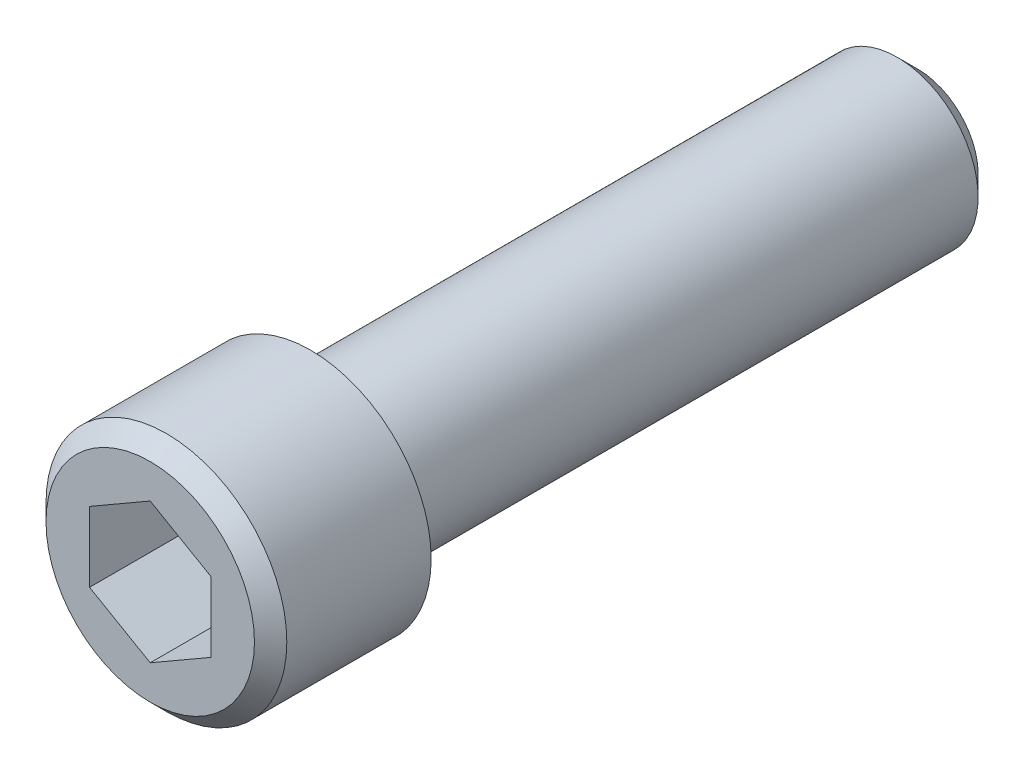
ISO-10303-21;
HEADER;
FILE_DESCRIPTION(('STEP AP214'),'2;1');
FILE_NAME('part.step','',(''),(''),'','','');
FILE_SCHEMA(('AUTOMOTIVE_DESIGN { 1 0 10303 214 1 1 1 1 }'));
ENDSEC;
DATA;
#1=APPLICATION_CONTEXT('core data for automotive mechanical design processes');
#2=APPLICATION_PROTOCOL_DEFINITION('international standard','automotive_design',2000,#1);
#3=PRODUCT_CONTEXT('',#1,'mechanical');
#4=PRODUCT('Part','Part','',(#3));
#5=PRODUCT_RELATED_PRODUCT_CATEGORY('part','',(#4));
#6=PRODUCT_DEFINITION_FORMATION('','',#4);
#7=PRODUCT_DEFINITION_CONTEXT('part definition',#1,'design');
#8=PRODUCT_DEFINITION('design','',#6,#7);
#9=PRODUCT_DEFINITION_SHAPE('','',#8);
#10=(LENGTH_UNIT() NAMED_UNIT(*) SI_UNIT(.MILLI.,.METRE.));
#11=(NAMED_UNIT(*) PLANE_ANGLE_UNIT() SI_UNIT($,.RADIAN.));
#12=(NAMED_UNIT(*) SI_UNIT($,.STERADIAN.) SOLID_ANGLE_UNIT());
#13=UNCERTAINTY_MEASURE_WITH_UNIT(LENGTH_MEASURE(1.E-05),#10,'distance_accuracy_value','');
#14=(GEOMETRIC_REPRESENTATION_CONTEXT(3) GLOBAL_UNCERTAINTY_ASSIGNED_CONTEXT((#13)) GLOBAL_UNIT_ASSIGNED_CONTEXT((#10,
#11,#12)) REPRESENTATION_CONTEXT('',''));
#15=CARTESIAN_POINT('',(0.,0.,0.));
#16=DIRECTION('',(0.,0.,1.));
#17=DIRECTION('',(1.,0.,0.));
#18=AXIS2_PLACEMENT_3D('',#15,#16,#17);
#19=CARTESIAN_POINT('',(3.,-5.19615242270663,3.4375));
#20=DIRECTION('',(0.,0.,1.));
#21=DIRECTION('',(1.,0.,0.));
#22=AXIS2_PLACEMENT_3D('',#19,#20,#21);
#23=PLANE('',#22);
#24=CARTESIAN_POINT('',(0.,0.,3.4375));
#25=DIRECTION('',(0.,0.,1.));
#26=DIRECTION('',(1.,0.,0.));
#27=AXIS2_PLACEMENT_3D('',#24,#25,#26);
#28=CIRCLE('',#27,3.);
#29=CARTESIAN_POINT('',(3.,0.,3.4375));
#30=VERTEX_POINT('',#29);
#31=CARTESIAN_POINT('',(1.5,2.59807621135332,3.4375));
#32=VERTEX_POINT('',#31);
#33=EDGE_CURVE('E25',#30,#32,#28,.T.);
#34=ORIENTED_EDGE('',*,*,#33,.F.);
#35=DIRECTION('',(0.,1.,0.));
#36=VECTOR('',#35,1.);
#37=CARTESIAN_POINT('',(3.,-1.73205080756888,3.4375));
#38=LINE('',#37,#36);
#39=CARTESIAN_POINT('',(3.,1.73205080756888,3.4375));
#40=VERTEX_POINT('',#39);
#41=EDGE_CURVE('E116',#30,#40,#38,.T.);
#42=ORIENTED_EDGE('',*,*,#41,.T.);
#43=DIRECTION('',(-0.866025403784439,0.5,0.));
#44=VECTOR('',#43,1.);
#45=CARTESIAN_POINT('',(3.,1.73205080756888,3.4375));
#46=LINE('',#45,#44);
#47=EDGE_CURVE('E112',#40,#32,#46,.T.);
#48=ORIENTED_EDGE('',*,*,#47,.T.);
#49=EDGE_LOOP('',(#34,#42,#48));
#50=FACE_BOUND('',#49,.T.);
#51=ADVANCED_FACE('F14',(#50),#23,.T.);
#52=CARTESIAN_POINT('',(-1.5,2.59807621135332,3.4375));
#53=VERTEX_POINT('',#52);
#54=EDGE_CURVE('E9',#32,#53,#28,.T.);
#55=ORIENTED_EDGE('',*,*,#54,.F.);
#56=CARTESIAN_POINT('',(0.,3.46410161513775,3.4375));
#57=VERTEX_POINT('',#56);
#58=EDGE_CURVE('E104',#32,#57,#46,.T.);
#59=ORIENTED_EDGE('',*,*,#58,.T.);
#60=DIRECTION('',(-0.866025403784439,-0.5,0.));
#61=VECTOR('',#60,1.);
#62=CARTESIAN_POINT('',(0.,3.46410161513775,3.4375));
#63=LINE('',#62,#61);
#64=EDGE_CURVE('E107',#57,#53,#63,.T.);
#65=ORIENTED_EDGE('',*,*,#64,.T.);
#66=EDGE_LOOP('',(#55,#59,#65));
#67=FACE_BOUND('',#66,.T.);
#68=ADVANCED_FACE('F103',(#67),#23,.T.);
#69=CARTESIAN_POINT('',(-3.,0.,3.4375));
#70=VERTEX_POINT('',#69);
#71=EDGE_CURVE('E23',#53,#70,#28,.T.);
#72=ORIENTED_EDGE('',*,*,#71,.F.);
#73=CARTESIAN_POINT('',(-3.,1.73205080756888,3.4375));
#74=VERTEX_POINT('',#73);
#75=EDGE_CURVE('E118',#53,#74,#63,.T.);
#76=ORIENTED_EDGE('',*,*,#75,.T.);
#77=DIRECTION('',(0.,-1.,0.));
#78=VECTOR('',#77,1.);
#79=CARTESIAN_POINT('',(-3.,1.73205080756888,3.4375));
#80=LINE('',#79,#78);
#81=EDGE_CURVE('E124',#74,#70,#80,.T.);
#82=ORIENTED_EDGE('',*,*,#81,.T.);
#83=EDGE_LOOP('',(#72,#76,#82));
#84=FACE_BOUND('',#83,.T.);
#85=ADVANCED_FACE('F204',(#84),#23,.T.);
#86=CARTESIAN_POINT('',(-1.5,-2.59807621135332,3.4375));
#87=VERTEX_POINT('',#86);
#88=EDGE_CURVE('E156',#70,#87,#28,.T.);
#89=ORIENTED_EDGE('',*,*,#88,.F.);
#90=CARTESIAN_POINT('',(-3.,-1.73205080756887,3.4375));
#91=VERTEX_POINT('',#90);
#92=EDGE_CURVE('E123',#70,#91,#80,.T.);
#93=ORIENTED_EDGE('',*,*,#92,.T.);
#94=DIRECTION('',(0.866025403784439,-0.5,0.));
#95=VECTOR('',#94,1.);
#96=CARTESIAN_POINT('',(-3.,-1.73205080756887,3.4375));
#97=LINE('',#96,#95);
#98=EDGE_CURVE('E174',#91,#87,#97,.T.);
#99=ORIENTED_EDGE('',*,*,#98,.T.);
#100=EDGE_LOOP('',(#89,#93,#99));
#101=FACE_BOUND('',#100,.T.);
#102=ADVANCED_FACE('F212',(#101),#23,.T.);
#103=CARTESIAN_POINT('',(1.5,-2.59807621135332,3.4375));
#104=VERTEX_POINT('',#103);
#105=EDGE_CURVE('E32',#87,#104,#28,.T.);
#106=ORIENTED_EDGE('',*,*,#105,.F.);
#107=CARTESIAN_POINT('',(0.,-3.46410161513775,3.4375));
#108=VERTEX_POINT('',#107);
#109=EDGE_CURVE('E173',#87,#108,#97,.T.);
#110=ORIENTED_EDGE('',*,*,#109,.T.);
#111=DIRECTION('',(0.866025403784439,0.5,0.));
#112=VECTOR('',#111,1.);
#113=CARTESIAN_POINT('',(0.,-3.46410161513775,3.4375));
#114=LINE('',#113,#112);
#115=EDGE_CURVE('E177',#108,#104,#114,.T.);
#116=ORIENTED_EDGE('',*,*,#115,.T.);
#117=EDGE_LOOP('',(#106,#110,#116));
#118=FACE_BOUND('',#117,.T.);
#119=ADVANCED_FACE('F209',(#118),#23,.T.);
#120=CARTESIAN_POINT('',(0.,5.95376,0.));
#121=DIRECTION('',(0.,0.,-1.));
#122=DIRECTION('',(-1.,0.,0.));
#123=AXIS2_PLACEMENT_3D('',#120,#121,#122);
#124=PLANE('',#123);
#125=CARTESIAN_POINT('',(0.,0.,0.));
#126=DIRECTION('',(0.,0.,1.));
#127=DIRECTION('',(1.,0.,0.));
#128=AXIS2_PLACEMENT_3D('',#125,#126,#127);
#129=CIRCLE('',#128,5.95376);
#130=CARTESIAN_POINT('',(5.95376,0.,0.));
#131=VERTEX_POINT('',#130);
#132=EDGE_CURVE('E147',#131,#131,#129,.T.);
#133=ORIENTED_EDGE('',*,*,#132,.F.);
#134=EDGE_LOOP('',(#133));
#135=FACE_BOUND('',#134,.T.);
#136=CARTESIAN_POINT('',(0.,0.,0.));
#137=DIRECTION('',(0.,0.,-1.));
#138=DIRECTION('',(-1.,0.,0.));
#139=AXIS2_PLACEMENT_3D('',#136,#137,#138);
#140=CIRCLE('',#139,4.);
#141=CARTESIAN_POINT('',(-4.,0.,0.));
#142=VERTEX_POINT('',#141);
#143=EDGE_CURVE('E130',#142,#142,#140,.T.);
#144=ORIENTED_EDGE('',*,*,#143,.F.);
#145=EDGE_LOOP('',(#144));
#146=FACE_BOUND('',#145,.T.);
#147=ADVANCED_FACE('F16',(#135,#146),#124,.T.);
#148=CARTESIAN_POINT('',(0.,0.,7.9375));
#149=DIRECTION('',(0.,0.,1.));
#150=DIRECTION('',(1.,0.,0.));
#151=AXIS2_PLACEMENT_3D('',#148,#149,#150);
#152=PLANE('',#151);
#153=DIRECTION('',(0.866025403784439,-0.5,0.));
#154=VECTOR('',#153,1.);
#155=CARTESIAN_POINT('',(-3.,-1.73205080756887,7.9375));
#156=LINE('',#155,#154);
#157=CARTESIAN_POINT('',(-3.,-1.73205080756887,7.9375));
#158=VERTEX_POINT('',#157);
#159=CARTESIAN_POINT('',(0.,-3.46410161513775,7.9375));
#160=VERTEX_POINT('',#159);
#161=EDGE_CURVE('E40',#158,#160,#156,.T.);
#162=ORIENTED_EDGE('',*,*,#161,.F.);
#163=DIRECTION('',(0.,-1.,0.));
#164=VECTOR('',#163,1.);
#165=CARTESIAN_POINT('',(-3.,1.73205080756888,7.9375));
#166=LINE('',#165,#164);
#167=CARTESIAN_POINT('',(-3.,1.73205080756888,7.9375));
#168=VERTEX_POINT('',#167);
#169=EDGE_CURVE('E170',#168,#158,#166,.T.);
#170=ORIENTED_EDGE('',*,*,#169,.F.);
#171=DIRECTION('',(-0.866025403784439,-0.5,0.));
#172=VECTOR('',#171,1.);
#173=CARTESIAN_POINT('',(0.,3.46410161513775,7.9375));
#174=LINE('',#173,#172);
#175=CARTESIAN_POINT('',(0.,3.46410161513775,7.9375));
#176=VERTEX_POINT('',#175);
#177=EDGE_CURVE('E167',#176,#168,#174,.T.);
#178=ORIENTED_EDGE('',*,*,#177,.F.);
#179=DIRECTION('',(-0.866025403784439,0.5,0.));
#180=VECTOR('',#179,1.);
#181=CARTESIAN_POINT('',(3.,1.73205080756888,7.9375));
#182=LINE('',#181,#180);
#183=CARTESIAN_POINT('',(3.,1.73205080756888,7.9375));
#184=VERTEX_POINT('',#183);
#185=EDGE_CURVE('E165',#184,#176,#182,.T.);
#186=ORIENTED_EDGE('',*,*,#185,.F.);
#187=DIRECTION('',(0.,1.,0.));
#188=VECTOR('',#187,1.);
#189=CARTESIAN_POINT('',(3.,-1.73205080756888,7.9375));
#190=LINE('',#189,#188);
#191=CARTESIAN_POINT('',(3.,-1.73205080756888,7.9375));
#192=VERTEX_POINT('',#191);
#193=EDGE_CURVE('E162',#192,#184,#190,.T.);
#194=ORIENTED_EDGE('',*,*,#193,.F.);
#195=DIRECTION('',(0.866025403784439,0.5,0.));
#196=VECTOR('',#195,1.);
#197=CARTESIAN_POINT('',(0.,-3.46410161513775,7.9375));
#198=LINE('',#197,#196);
#199=EDGE_CURVE('E159',#160,#192,#198,.T.);
#200=ORIENTED_EDGE('',*,*,#199,.F.);
#201=EDGE_LOOP('',(#162,#170,#178,#186,#194,#200));
#202=FACE_BOUND('',#201,.T.);
#203=CARTESIAN_POINT('',(0.,0.,7.9375));
#204=DIRECTION('',(0.,0.,1.));
#205=DIRECTION('',(1.,0.,0.));
#206=AXIS2_PLACEMENT_3D('',#203,#204,#205);
#207=CIRCLE('',#206,5.15366);
#208=CARTESIAN_POINT('',(5.15366,0.,7.9375));
#209=VERTEX_POINT('',#208);
#210=EDGE_CURVE('E141',#209,#209,#207,.T.);
#211=ORIENTED_EDGE('',*,*,#210,.T.);
#212=EDGE_LOOP('',(#211));
#213=FACE_BOUND('',#212,.T.);
#214=ADVANCED_FACE('F196',(#202,#213),#152,.T.);
#215=CARTESIAN_POINT('',(0.,0.,39.6875));
#216=DIRECTION('',(0.,0.,1.));
#217=DIRECTION('',(1.,0.,0.));
#218=AXIS2_PLACEMENT_3D('',#215,#216,#217);
#219=CYLINDRICAL_SURFACE('',#218,5.95376);
#220=ORIENTED_EDGE('',*,*,#132,.T.);
#221=EDGE_LOOP('',(#220));
#222=FACE_BOUND('',#221,.T.);
#223=CARTESIAN_POINT('',(0.,0.,7.1374));
#224=DIRECTION('',(0.,0.,1.));
#225=DIRECTION('',(1.,0.,0.));
#226=AXIS2_PLACEMENT_3D('',#223,#224,#225);
#227=CIRCLE('',#226,5.95376);
#228=CARTESIAN_POINT('',(5.95376,0.,7.1374));
#229=VERTEX_POINT('',#228);
#230=EDGE_CURVE('E144',#229,#229,#227,.T.);
#231=ORIENTED_EDGE('',*,*,#230,.F.);
#232=EDGE_LOOP('',(#231));
#233=FACE_BOUND('',#232,.T.);
#234=ADVANCED_FACE('F302',(#222,#233),#219,.T.);
#235=CARTESIAN_POINT('',(0.,0.,7.9375));
#236=DIRECTION('',(0.,0.,-1.));
#237=DIRECTION('',(-1.,0.,0.));
#238=AXIS2_PLACEMENT_3D('',#235,#236,#237);
#239=CONICAL_SURFACE('',#238,5.15366,0.785398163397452);
#240=ORIENTED_EDGE('',*,*,#230,.T.);
#241=EDGE_LOOP('',(#240));
#242=FACE_BOUND('',#241,.T.);
#243=ORIENTED_EDGE('',*,*,#210,.F.);
#244=EDGE_LOOP('',(#243));
#245=FACE_BOUND('',#244,.T.);
#246=ADVANCED_FACE('F309',(#242,#245),#239,.T.);
#247=CARTESIAN_POINT('',(0.,0.,-30.));
#248=DIRECTION('',(0.,0.,1.));
#249=DIRECTION('',(1.,0.,0.));
#250=AXIS2_PLACEMENT_3D('',#247,#248,#249);
#251=CYLINDRICAL_SURFACE('',#250,4.);
#252=CARTESIAN_POINT('',(0.,0.,-29.));
#253=DIRECTION('',(0.,0.,-1.));
#254=DIRECTION('',(-1.,0.,0.));
#255=AXIS2_PLACEMENT_3D('',#252,#253,#254);
#256=CIRCLE('',#255,4.);
#257=CARTESIAN_POINT('',(-4.,0.,-29.));
#258=VERTEX_POINT('',#257);
#259=EDGE_CURVE('E18',#258,#258,#256,.F.);
#260=ORIENTED_EDGE('',*,*,#259,.T.);
#261=EDGE_LOOP('',(#260));
#262=FACE_BOUND('',#261,.T.);
#263=ORIENTED_EDGE('',*,*,#143,.T.);
#264=EDGE_LOOP('',(#263));
#265=FACE_BOUND('',#264,.T.);
#266=ADVANCED_FACE('F317',(#262,#265),#251,.T.);
#267=CARTESIAN_POINT('',(0.,0.,-30.));
#268=DIRECTION('',(0.,0.,-1.));
#269=DIRECTION('',(-1.,0.,0.));
#270=AXIS2_PLACEMENT_3D('',#267,#268,#269);
#271=PLANE('',#270);
#272=CARTESIAN_POINT('',(0.,0.,-30.));
#273=DIRECTION('',(0.,0.,-1.));
#274=DIRECTION('',(-1.,0.,0.));
#275=AXIS2_PLACEMENT_3D('',#272,#273,#274);
#276=CIRCLE('',#275,3.);
#277=CARTESIAN_POINT('',(-3.,0.,-30.));
#278=VERTEX_POINT('',#277);
#279=EDGE_CURVE('E149',#278,#278,#276,.T.);
#280=ORIENTED_EDGE('',*,*,#279,.T.);
#281=EDGE_LOOP('',(#280));
#282=FACE_BOUND('',#281,.T.);
#283=ADVANCED_FACE('F326',(#282),#271,.T.);
#284=CARTESIAN_POINT('',(0.,0.,-30.));
#285=DIRECTION('',(0.,0.,1.));
#286=DIRECTION('',(1.,0.,0.));
#287=AXIS2_PLACEMENT_3D('',#284,#285,#286);
#288=CONICAL_SURFACE('',#287,3.,0.785398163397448);
#289=ORIENTED_EDGE('',*,*,#259,.F.);
#290=EDGE_LOOP('',(#289));
#291=FACE_BOUND('',#290,.T.);
#292=ORIENTED_EDGE('',*,*,#279,.F.);
#293=EDGE_LOOP('',(#292));
#294=FACE_BOUND('',#293,.T.);
#295=ADVANCED_FACE('F225',(#291,#294),#288,.T.);
#296=CARTESIAN_POINT('',(-3.,-1.73205080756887,3.4375));
#297=DIRECTION('',(-0.5,-0.866025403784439,0.));
#298=DIRECTION('',(-0.866025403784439,0.5,0.));
#299=AXIS2_PLACEMENT_3D('',#296,#297,#298);
#300=PLANE('',#299);
#301=ORIENTED_EDGE('',*,*,#161,.T.);
#302=DIRECTION('',(0.,0.,1.));
#303=VECTOR('',#302,1.);
#304=CARTESIAN_POINT('',(0.,-3.46410161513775,3.4375));
#305=LINE('',#304,#303);
#306=EDGE_CURVE('E127',#108,#160,#305,.T.);
#307=ORIENTED_EDGE('',*,*,#306,.F.);
#308=ORIENTED_EDGE('',*,*,#109,.F.);
#309=ORIENTED_EDGE('',*,*,#98,.F.);
#310=DIRECTION('',(0.,0.,1.));
#311=VECTOR('',#310,1.);
#312=CARTESIAN_POINT('',(-3.,-1.73205080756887,3.4375));
#313=LINE('',#312,#311);
#314=EDGE_CURVE('E128',#91,#158,#313,.T.);
#315=ORIENTED_EDGE('',*,*,#314,.T.);
#316=EDGE_LOOP('',(#301,#307,#308,#309,#315));
#317=FACE_BOUND('',#316,.T.);
#318=ADVANCED_FACE('F211',(#317),#300,.F.);
#319=CARTESIAN_POINT('',(-3.,1.73205080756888,3.4375));
#320=DIRECTION('',(-1.,0.,0.));
#321=DIRECTION('',(0.,1.,0.));
#322=AXIS2_PLACEMENT_3D('',#319,#320,#321);
#323=PLANE('',#322);
#324=ORIENTED_EDGE('',*,*,#169,.T.);
#325=ORIENTED_EDGE('',*,*,#314,.F.);
#326=ORIENTED_EDGE('',*,*,#92,.F.);
#327=ORIENTED_EDGE('',*,*,#81,.F.);
#328=DIRECTION('',(0.,0.,1.));
#329=VECTOR('',#328,1.);
#330=CARTESIAN_POINT('',(-3.,1.73205080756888,3.4375));
#331=LINE('',#330,#329);
#332=EDGE_CURVE('E131',#74,#168,#331,.T.);
#333=ORIENTED_EDGE('',*,*,#332,.T.);
#334=EDGE_LOOP('',(#324,#325,#326,#327,#333));
#335=FACE_BOUND('',#334,.T.);
#336=ADVANCED_FACE('F215',(#335),#323,.F.);
#337=CARTESIAN_POINT('',(0.,3.46410161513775,3.4375));
#338=DIRECTION('',(-0.5,0.866025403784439,0.));
#339=DIRECTION('',(0.866025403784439,0.5,0.));
#340=AXIS2_PLACEMENT_3D('',#337,#338,#339);
#341=PLANE('',#340);
#342=ORIENTED_EDGE('',*,*,#177,.T.);
#343=ORIENTED_EDGE('',*,*,#332,.F.);
#344=ORIENTED_EDGE('',*,*,#75,.F.);
#345=ORIENTED_EDGE('',*,*,#64,.F.);
#346=DIRECTION('',(0.,0.,1.));
#347=VECTOR('',#346,1.);
#348=CARTESIAN_POINT('',(0.,3.46410161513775,3.4375));
#349=LINE('',#348,#347);
#350=EDGE_CURVE('E113',#57,#176,#349,.T.);
#351=ORIENTED_EDGE('',*,*,#350,.T.);
#352=EDGE_LOOP('',(#342,#343,#344,#345,#351));
#353=FACE_BOUND('',#352,.T.);
#354=ADVANCED_FACE('F200',(#353),#341,.F.);
#355=CARTESIAN_POINT('',(3.,1.73205080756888,3.4375));
#356=DIRECTION('',(0.5,0.866025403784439,0.));
#357=DIRECTION('',(0.866025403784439,-0.5,0.));
#358=AXIS2_PLACEMENT_3D('',#355,#356,#357);
#359=PLANE('',#358);
#360=ORIENTED_EDGE('',*,*,#185,.T.);
#361=ORIENTED_EDGE('',*,*,#350,.F.);
#362=ORIENTED_EDGE('',*,*,#58,.F.);
#363=ORIENTED_EDGE('',*,*,#47,.F.);
#364=DIRECTION('',(0.,0.,1.));
#365=VECTOR('',#364,1.);
#366=CARTESIAN_POINT('',(3.,1.73205080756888,3.4375));
#367=LINE('',#366,#365);
#368=EDGE_CURVE('E134',#40,#184,#367,.T.);
#369=ORIENTED_EDGE('',*,*,#368,.T.);
#370=EDGE_LOOP('',(#360,#361,#362,#363,#369));
#371=FACE_BOUND('',#370,.T.);
#372=ADVANCED_FACE('F111',(#371),#359,.F.);
#373=CARTESIAN_POINT('',(3.,-1.73205080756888,3.4375));
#374=DIRECTION('',(1.,0.,0.));
#375=DIRECTION('',(0.,-1.,0.));
#376=AXIS2_PLACEMENT_3D('',#373,#374,#375);
#377=PLANE('',#376);
#378=ORIENTED_EDGE('',*,*,#193,.T.);
#379=ORIENTED_EDGE('',*,*,#368,.F.);
#380=ORIENTED_EDGE('',*,*,#41,.F.);
#381=CARTESIAN_POINT('',(3.,-1.73205080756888,3.4375));
#382=VERTEX_POINT('',#381);
#383=EDGE_CURVE('E114',#382,#30,#38,.T.);
#384=ORIENTED_EDGE('',*,*,#383,.F.);
#385=DIRECTION('',(0.,0.,1.));
#386=VECTOR('',#385,1.);
#387=CARTESIAN_POINT('',(3.,-1.73205080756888,3.4375));
#388=LINE('',#387,#386);
#389=EDGE_CURVE('E136',#382,#192,#388,.T.);
#390=ORIENTED_EDGE('',*,*,#389,.T.);
#391=EDGE_LOOP('',(#378,#379,#380,#384,#390));
#392=FACE_BOUND('',#391,.T.);
#393=ADVANCED_FACE('F191',(#392),#377,.F.);
#394=CARTESIAN_POINT('',(0.,-3.46410161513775,3.4375));
#395=DIRECTION('',(0.5,-0.866025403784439,0.));
#396=DIRECTION('',(-0.866025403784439,-0.5,0.));
#397=AXIS2_PLACEMENT_3D('',#394,#395,#396);
#398=PLANE('',#397);
#399=ORIENTED_EDGE('',*,*,#199,.T.);
#400=ORIENTED_EDGE('',*,*,#389,.F.);
#401=EDGE_CURVE('E176',#104,#382,#114,.T.);
#402=ORIENTED_EDGE('',*,*,#401,.F.);
#403=ORIENTED_EDGE('',*,*,#115,.F.);
#404=ORIENTED_EDGE('',*,*,#306,.T.);
#405=EDGE_LOOP('',(#399,#400,#402,#403,#404));
#406=FACE_BOUND('',#405,.T.);
#407=ADVANCED_FACE('F187',(#406),#398,.F.);
#408=EDGE_CURVE('E96',#104,#30,#28,.T.);
#409=ORIENTED_EDGE('',*,*,#408,.F.);
#410=ORIENTED_EDGE('',*,*,#401,.T.);
#411=ORIENTED_EDGE('',*,*,#383,.T.);
#412=EDGE_LOOP('',(#409,#410,#411));
#413=FACE_BOUND('',#412,.T.);
#414=ADVANCED_FACE('F91',(#413),#23,.T.);
#415=CARTESIAN_POINT('',(0.,0.,3.4375));
#416=DIRECTION('',(0.,0.,1.));
#417=DIRECTION('',(1.,0.,0.));
#418=AXIS2_PLACEMENT_3D('',#415,#416,#417);
#419=CONICAL_SURFACE('',#418,3.,1.0471975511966);
#420=CARTESIAN_POINT('',(0.,0.,1.70544919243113));
#421=VERTEX_POINT('',#420);
#422=VERTEX_LOOP('',#421);
#423=FACE_BOUND('',#422,.T.);
#424=ORIENTED_EDGE('',*,*,#33,.T.);
#425=ORIENTED_EDGE('',*,*,#54,.T.);
#426=ORIENTED_EDGE('',*,*,#71,.T.);
#427=ORIENTED_EDGE('',*,*,#88,.T.);
#428=ORIENTED_EDGE('',*,*,#105,.T.);
#429=ORIENTED_EDGE('',*,*,#408,.T.);
#430=EDGE_LOOP('',(#424,#425,#426,#427,#428,#429));
#431=FACE_BOUND('',#430,.T.);
#432=ADVANCED_FACE('F89',(#423,#431),#419,.F.);
#433=CLOSED_SHELL('',(#51,#68,#85,#102,#119,#147,#214,#234,#246,#266,#283,#295,#318,#336,#354,
#372,#393,#407,#414,#432));
#434=MANIFOLD_SOLID_BREP('B1',#433);
#435=ADVANCED_BREP_SHAPE_REPRESENTATION('',(#18,#434),#14);
#436=SHAPE_DEFINITION_REPRESENTATION(#9,#435);
ENDSEC;
END-ISO-10303-21;
